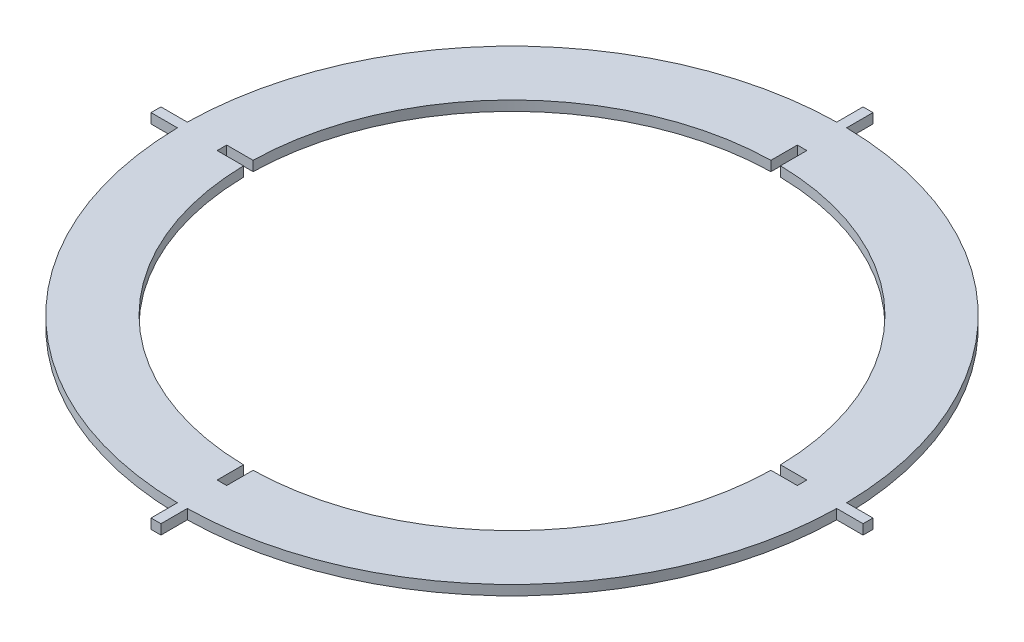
from build123d import *

# Parameters (mm, degrees)
BOSS_EXTRUDE1_DEPTH = 3


with BuildPart() as part:
    # Sketch1 → Boss-Extrude1 (new body)
    with BuildSketch(Plane(origin=(0, 0, 0), x_dir=(1, 0, 0), z_dir=(0, 1, 0))):
        with BuildLine():
            Line((107.988749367, 1.5), (99.988749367, 1.5))
            ThreePointArc((99.988749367, 1.5), (70.710678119, 70.710678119), (1.5, 99.988749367))
            Line((1.5, 99.988749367), (1.5, 107.988749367))
            Line((1.5, 107.988749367), (-1.5, 107.988749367))
            Line((-1.5, 107.988749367), (-1.5, 99.988749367))
            ThreePointArc((-1.5, 99.988749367), (-70.710678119, 70.710678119), (-99.988749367, 1.5))
            Line((-99.988749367, 1.5), (-107.988749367, 1.5))
            Line((-107.988749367, 1.5), (-107.988749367, -1.5))
            Line((-107.988749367, -1.5), (-99.988749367, -1.5))
            ThreePointArc((-99.988749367, -1.5), (-70.710678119, -70.710678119), (-1.5, -99.988749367))
            Line((-1.5, -99.988749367), (-1.5, -107.988749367))
            Line((-1.5, -107.988749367), (1.5, -107.988749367))
            Line((1.5, -107.988749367), (1.5, -99.988749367))
            ThreePointArc((1.5, -99.988749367), (70.710678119, -70.710678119), (99.988749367, -1.5))
            Line((99.988749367, -1.5), (107.988749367, -1.5))
            Line((107.988749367, -1.5), (107.988749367, 1.5))
        make_face()
        with BuildLine():
            ThreePointArc((79.986858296, 1.45), (56.568542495, 56.568542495), (1.45, 79.986858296))
            Line((1.45, 79.986858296), (1.45, 87.986858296))
            Line((1.45, 87.986858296), (-1.45, 87.986858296))
            Line((-1.45, 87.986858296), (-1.45, 79.986858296))
            ThreePointArc((-1.45, 79.986858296), (-56.568542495, 56.568542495), (-79.986858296, 1.45))
            Line((-79.986858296, 1.45), (-87.986858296, 1.45))
            Line((-87.986858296, 1.45), (-87.986858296, -1.45))
            Line((-87.986858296, -1.45), (-79.986858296, -1.45))
            ThreePointArc((-79.986858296, -1.45), (-56.568542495, -56.568542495), (-1.45, -79.986858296))
            Line((-1.45, -79.986858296), (-1.45, -87.986858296))
            Line((-1.45, -87.986858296), (1.45, -87.986858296))
            Line((1.45, -87.986858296), (1.45, -79.986858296))
            ThreePointArc((1.45, -79.986858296), (56.568542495, -56.568542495), (79.986858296, -1.45))
            Line((79.986858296, -1.45), (87.986858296, -1.45))
            Line((87.986858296, -1.45), (87.986858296, 1.45))
            Line((87.986858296, 1.45), (79.986858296, 1.45))
        make_face(mode=Mode.SUBTRACT)
    extrude(amount=BOSS_EXTRUDE1_DEPTH)


solid = part.part
